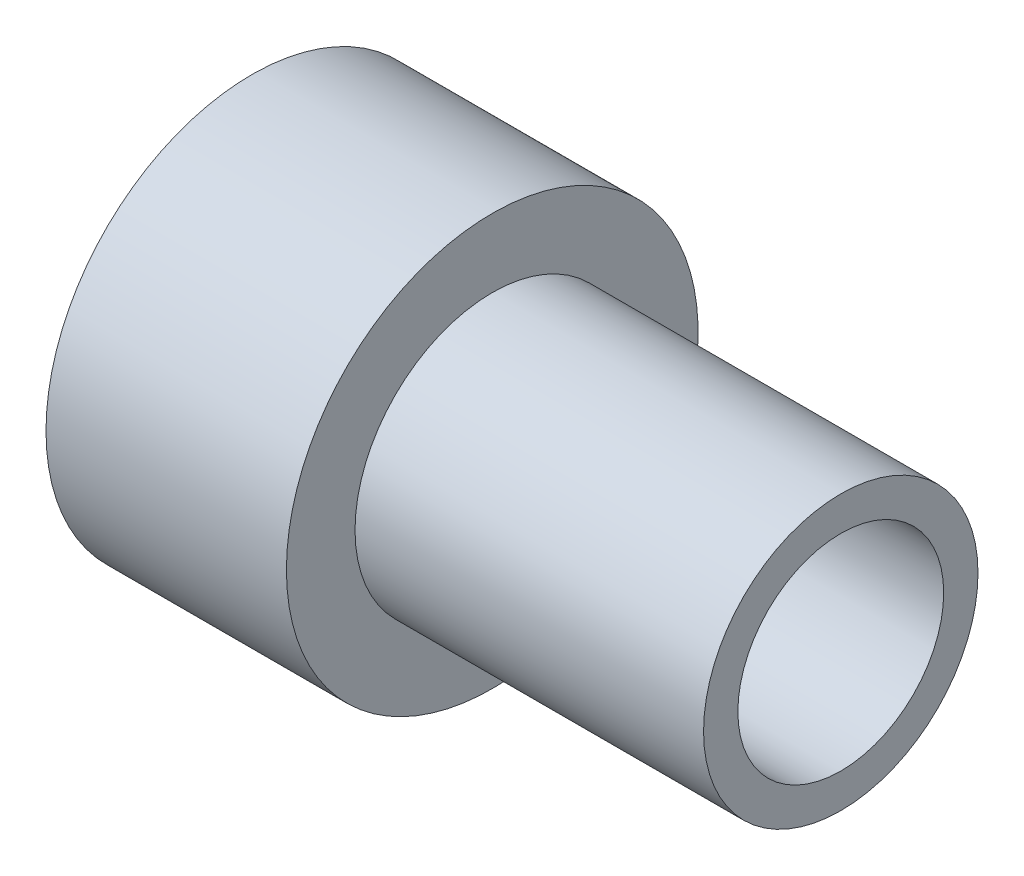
from build123d import *


with BuildPart() as part:
    # Sketch1 → Revolve1 (revolve)
    with BuildSketch(Plane.XY, mode=Mode.PRIVATE) as revolve1_sk:
        Polygon((0, 4.7625), (27.2542, 4.7625), (27.2542, 6.35), (11.1252, 6.35), (11.1252, 9.525), (0, 9.525), align=None)
    revolve(revolve1_sk.sketch.rotate(Axis((0, 0, 0), (1, 0, 0)), 90), axis=Axis((0, 0, 0), (1, 0, 0)))


solid = part.part
